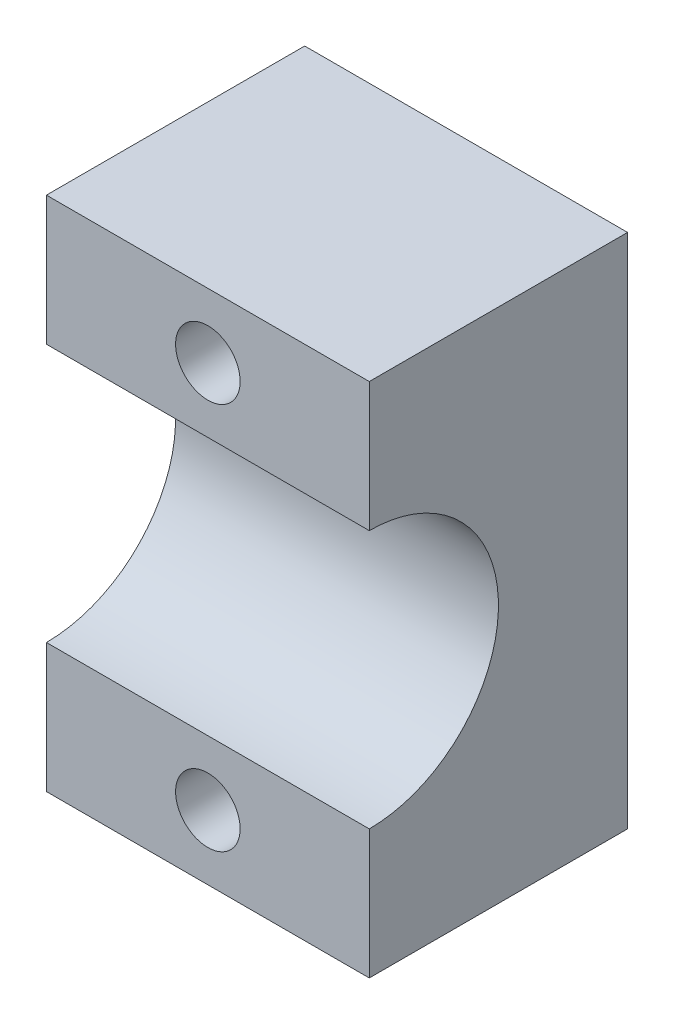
from build123d import *

# Parameters (mm, degrees)
ESQUISSE1_W             = 10
ESQUISSE1_H             = 16
BOSS_EXTRU_1_DEPTH      = 8
ESQUISSE2_R             = 4
ENL_V_MAT_EXTRU_1_DEPTH = 13
ESQUISSE3_R             = 1
ENL_V_MAT_EXTRU_2_DEPTH = 13


with BuildPart() as part:
    # Esquisse1 → Boss.-Extru.1 (new body)
    with BuildSketch(Plane.XY):
        with Locations((-18.4, 0)):
            Rectangle(ESQUISSE1_W, ESQUISSE1_H)
    extrude(amount=BOSS_EXTRU_1_DEPTH)

    # Esquisse2 → Enl_v. mat.-Extru.1 (cut)
    with BuildSketch(Plane(origin=(-13.4, 0, 0), x_dir=(0, 0, -1), z_dir=(1, 0, 0))):
        with Locations((-8, 0)):
            Circle(ESQUISSE2_R)
    extrude(amount=-ENL_V_MAT_EXTRU_1_DEPTH, mode=Mode.SUBTRACT)

    # Esquisse3 → Enl_v. mat.-Extru.2 (cut)
    with BuildSketch(Plane.XY.offset(8)):
        with Locations((-18.4, 6)):
            Circle(ESQUISSE3_R)
        with Locations((-18.4, -6)):
            Circle(ESQUISSE3_R)
    extrude(amount=-ENL_V_MAT_EXTRU_2_DEPTH, mode=Mode.SUBTRACT)


solid = part.part
